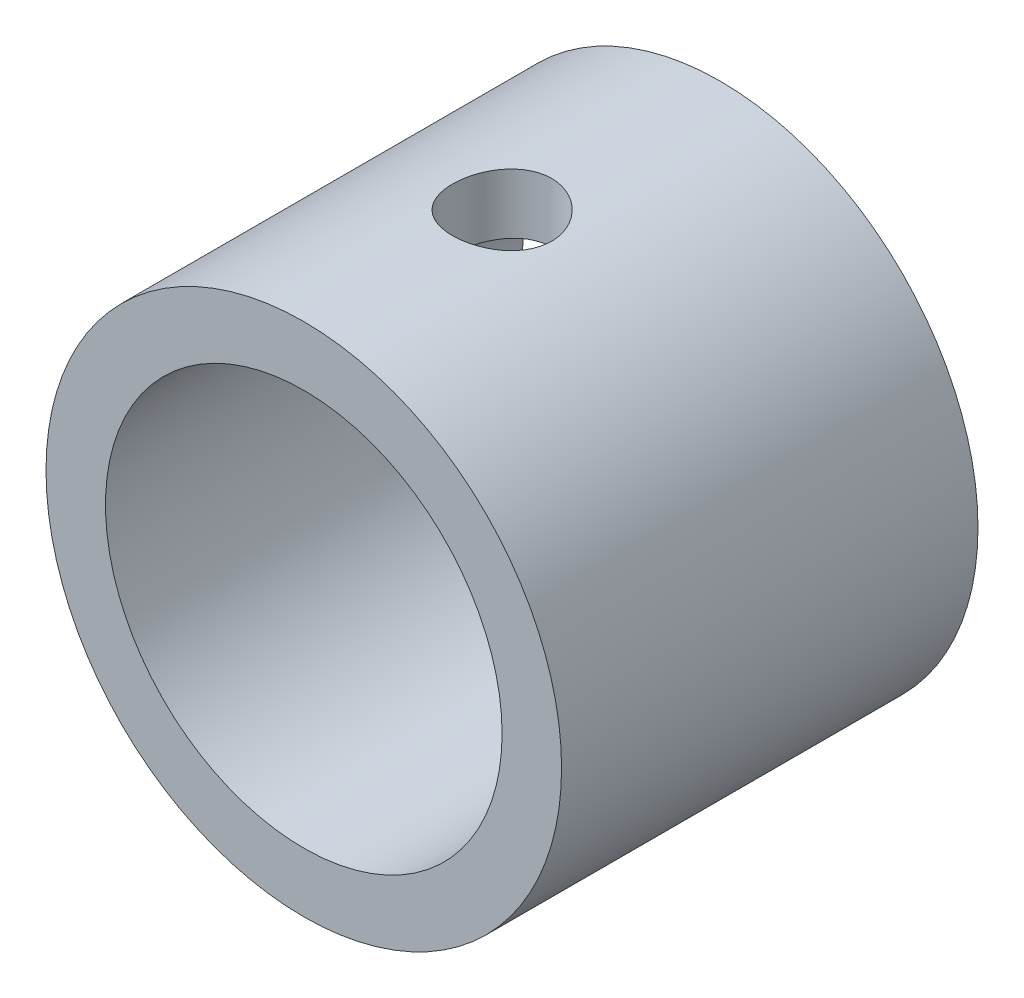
ISO-10303-21;
HEADER;
FILE_DESCRIPTION(('STEP AP214'),'2;1');
FILE_NAME('part.step','',(''),(''),'','','');
FILE_SCHEMA(('AUTOMOTIVE_DESIGN { 1 0 10303 214 1 1 1 1 }'));
ENDSEC;
DATA;
#1=APPLICATION_CONTEXT('core data for automotive mechanical design processes');
#2=APPLICATION_PROTOCOL_DEFINITION('international standard','automotive_design',2000,#1);
#3=PRODUCT_CONTEXT('',#1,'mechanical');
#4=PRODUCT('Part','Part','',(#3));
#5=PRODUCT_RELATED_PRODUCT_CATEGORY('part','',(#4));
#6=PRODUCT_DEFINITION_FORMATION('','',#4);
#7=PRODUCT_DEFINITION_CONTEXT('part definition',#1,'design');
#8=PRODUCT_DEFINITION('design','',#6,#7);
#9=PRODUCT_DEFINITION_SHAPE('','',#8);
#10=(LENGTH_UNIT() NAMED_UNIT(*) SI_UNIT(.MILLI.,.METRE.));
#11=(NAMED_UNIT(*) PLANE_ANGLE_UNIT() SI_UNIT($,.RADIAN.));
#12=(NAMED_UNIT(*) SI_UNIT($,.STERADIAN.) SOLID_ANGLE_UNIT());
#13=UNCERTAINTY_MEASURE_WITH_UNIT(LENGTH_MEASURE(1.E-05),#10,'distance_accuracy_value','');
#14=(GEOMETRIC_REPRESENTATION_CONTEXT(3) GLOBAL_UNCERTAINTY_ASSIGNED_CONTEXT((#13)) GLOBAL_UNIT_ASSIGNED_CONTEXT((#10,
#11,#12)) REPRESENTATION_CONTEXT('',''));
#15=CARTESIAN_POINT('',(0.,0.,0.));
#16=DIRECTION('',(0.,0.,1.));
#17=DIRECTION('',(1.,0.,0.));
#18=AXIS2_PLACEMENT_3D('',#15,#16,#17);
#19=CARTESIAN_POINT('',(0.,0.,21.));
#20=DIRECTION('',(0.,0.,1.));
#21=DIRECTION('',(1.,0.,0.));
#22=AXIS2_PLACEMENT_3D('',#19,#20,#21);
#23=PLANE('',#22);
#24=CARTESIAN_POINT('',(0.,0.,21.));
#25=DIRECTION('',(0.,0.,1.));
#26=DIRECTION('',(1.,0.,0.));
#27=AXIS2_PLACEMENT_3D('',#24,#25,#26);
#28=CIRCLE('',#27,13.);
#29=CARTESIAN_POINT('',(13.,0.,21.));
#30=VERTEX_POINT('',#29);
#31=EDGE_CURVE('E10',#30,#30,#28,.T.);
#32=ORIENTED_EDGE('',*,*,#31,.T.);
#33=EDGE_LOOP('',(#32));
#34=FACE_BOUND('',#33,.T.);
#35=CARTESIAN_POINT('',(0.,0.,21.));
#36=DIRECTION('',(0.,0.,1.));
#37=DIRECTION('',(1.,0.,0.));
#38=AXIS2_PLACEMENT_3D('',#35,#36,#37);
#39=CIRCLE('',#38,10.);
#40=CARTESIAN_POINT('',(10.,0.,21.));
#41=VERTEX_POINT('',#40);
#42=EDGE_CURVE('E45',#41,#41,#39,.T.);
#43=ORIENTED_EDGE('',*,*,#42,.F.);
#44=EDGE_LOOP('',(#43));
#45=FACE_BOUND('',#44,.T.);
#46=ADVANCED_FACE('F28',(#34,#45),#23,.T.);
#47=CARTESIAN_POINT('',(0.,0.,0.));
#48=DIRECTION('',(0.,0.,1.));
#49=DIRECTION('',(1.,0.,0.));
#50=AXIS2_PLACEMENT_3D('',#47,#48,#49);
#51=PLANE('',#50);
#52=CARTESIAN_POINT('',(0.,0.,0.));
#53=DIRECTION('',(0.,0.,1.));
#54=DIRECTION('',(1.,0.,0.));
#55=AXIS2_PLACEMENT_3D('',#52,#53,#54);
#56=CIRCLE('',#55,13.);
#57=CARTESIAN_POINT('',(13.,0.,0.));
#58=VERTEX_POINT('',#57);
#59=EDGE_CURVE('E41',#58,#58,#56,.T.);
#60=ORIENTED_EDGE('',*,*,#59,.F.);
#61=EDGE_LOOP('',(#60));
#62=FACE_BOUND('',#61,.T.);
#63=CARTESIAN_POINT('',(0.,0.,0.));
#64=DIRECTION('',(0.,0.,1.));
#65=DIRECTION('',(1.,0.,0.));
#66=AXIS2_PLACEMENT_3D('',#63,#64,#65);
#67=CIRCLE('',#66,10.);
#68=CARTESIAN_POINT('',(10.,0.,0.));
#69=VERTEX_POINT('',#68);
#70=EDGE_CURVE('E50',#69,#69,#67,.T.);
#71=ORIENTED_EDGE('',*,*,#70,.T.);
#72=EDGE_LOOP('',(#71));
#73=FACE_BOUND('',#72,.T.);
#74=ADVANCED_FACE('F67',(#62,#73),#51,.F.);
#75=CARTESIAN_POINT('',(0.,0.,21.));
#76=DIRECTION('',(0.,0.,-1.));
#77=DIRECTION('',(-1.,0.,0.));
#78=AXIS2_PLACEMENT_3D('',#75,#76,#77);
#79=CYLINDRICAL_SURFACE('',#78,13.);
#80=CARTESIAN_POINT('',(0.,13.,8.50000000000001));
#81=CARTESIAN_POINT('',(0.139052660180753,12.9999974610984,8.50000524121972));
#82=CARTESIAN_POINT('',(0.278172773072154,12.9977459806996,8.511640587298));
#83=CARTESIAN_POINT('',(0.552488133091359,12.9889814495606,8.55784194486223));
#84=CARTESIAN_POINT('',(0.687680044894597,12.9824648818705,8.59242688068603));
#85=CARTESIAN_POINT('',(0.950132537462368,12.9658986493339,8.68342558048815));
#86=CARTESIAN_POINT('',(1.07740031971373,12.9558522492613,8.73981917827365));
#87=CARTESIAN_POINT('',(1.32065723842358,12.9333215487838,8.87277612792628));
#88=CARTESIAN_POINT('',(1.43664719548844,12.9208374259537,8.94933801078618));
#89=CARTESIAN_POINT('',(1.65552432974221,12.8946323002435,9.12147916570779));
#90=CARTESIAN_POINT('',(1.75824929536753,12.8808989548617,9.21726283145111));
#91=CARTESIAN_POINT('',(1.94627668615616,12.8538341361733,9.42468903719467));
#92=CARTESIAN_POINT('',(2.03157781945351,12.8405026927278,9.53633275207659));
#93=CARTESIAN_POINT('',(2.18301679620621,12.8156309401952,9.77346399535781));
#94=CARTESIAN_POINT('',(2.24898851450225,12.8041065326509,9.89905943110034));
#95=CARTESIAN_POINT('',(2.35883220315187,12.7843281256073,10.1598099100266));
#96=CARTESIAN_POINT('',(2.40270618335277,12.7760738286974,10.2949640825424));
#97=CARTESIAN_POINT('',(2.46658610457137,12.7638947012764,10.5692561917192));
#98=CARTESIAN_POINT('',(2.48687558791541,12.7599184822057,10.7083257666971));
#99=CARTESIAN_POINT('',(2.5038909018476,12.7565908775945,10.98794763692));
#100=CARTESIAN_POINT('',(2.50061895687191,12.7572390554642,11.1284997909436));
#101=CARTESIAN_POINT('',(2.47083395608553,12.763040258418,11.4050352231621));
#102=CARTESIAN_POINT('',(2.44464430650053,12.7681305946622,11.5410548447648));
#103=CARTESIAN_POINT('',(2.37027708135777,12.7821440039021,11.8067329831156));
#104=CARTESIAN_POINT('',(2.3220985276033,12.7910672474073,11.9363912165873));
#105=CARTESIAN_POINT('',(2.20480765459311,12.8118060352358,12.1866069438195));
#106=CARTESIAN_POINT('',(2.13556565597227,12.8236394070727,12.307102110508));
#107=CARTESIAN_POINT('',(1.97820505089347,12.848853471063,12.5348849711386));
#108=CARTESIAN_POINT('',(1.89008443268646,12.8622343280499,12.6421712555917));
#109=CARTESIAN_POINT('',(1.69572891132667,12.889308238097,12.8423585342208));
#110=CARTESIAN_POINT('',(1.58921761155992,12.9030027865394,12.9349911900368));
#111=CARTESIAN_POINT('',(1.36202665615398,12.9289572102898,13.1011155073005));
#112=CARTESIAN_POINT('',(1.24134684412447,12.9412170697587,13.1746069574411));
#113=CARTESIAN_POINT('',(0.98895776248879,12.9629474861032,13.3004060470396));
#114=CARTESIAN_POINT('',(0.857233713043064,12.9724142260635,13.3526847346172));
#115=CARTESIAN_POINT('',(0.586650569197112,12.9874624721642,13.4342974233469));
#116=CARTESIAN_POINT('',(0.447792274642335,12.993044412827,13.4636339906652));
#117=CARTESIAN_POINT('',(0.169189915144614,12.9996341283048,13.4981537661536));
#118=CARTESIAN_POINT('',(0.0294929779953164,13.0007114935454,13.503704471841));
#119=CARTESIAN_POINT('',(-0.248832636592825,12.9983632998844,13.4914822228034));
#120=CARTESIAN_POINT('',(-0.387461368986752,12.994937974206,13.4737104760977));
#121=CARTESIAN_POINT('',(-0.658542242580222,12.9840126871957,13.415653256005));
#122=CARTESIAN_POINT('',(-0.791035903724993,12.976546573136,13.3755547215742));
#123=CARTESIAN_POINT('',(-1.04741955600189,12.9583735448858,13.2741852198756));
#124=CARTESIAN_POINT('',(-1.1713089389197,12.9476664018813,13.2129127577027));
#125=CARTESIAN_POINT('',(-1.40852868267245,12.924025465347,13.0701282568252));
#126=CARTESIAN_POINT('',(-1.52172218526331,12.9110676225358,12.9883929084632));
#127=CARTESIAN_POINT('',(-1.73291860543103,12.8844225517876,12.8073037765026));
#128=CARTESIAN_POINT('',(-1.83092002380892,12.8707352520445,12.707948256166));
#129=CARTESIAN_POINT('',(-2.01035510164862,12.8439416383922,12.492771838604));
#130=CARTESIAN_POINT('',(-2.09153739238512,12.8308461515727,12.376739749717));
#131=CARTESIAN_POINT('',(-2.23325948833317,12.8069410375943,12.1324696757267));
#132=CARTESIAN_POINT('',(-2.29380008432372,12.796131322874,12.0042321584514));
#133=CARTESIAN_POINT('',(-2.39216884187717,12.7781075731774,11.7398136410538));
#134=CARTESIAN_POINT('',(-2.43010977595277,12.770875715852,11.6036758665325));
#135=CARTESIAN_POINT('',(-2.48254790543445,12.7607868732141,11.3268049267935));
#136=CARTESIAN_POINT('',(-2.49704789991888,12.7579293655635,11.1860723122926));
#137=CARTESIAN_POINT('',(-2.50209511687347,12.7569402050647,10.9065266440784));
#138=CARTESIAN_POINT('',(-2.49303910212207,12.7587302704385,10.7677208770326));
#139=CARTESIAN_POINT('',(-2.4521026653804,12.7666604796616,10.4936500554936));
#140=CARTESIAN_POINT('',(-2.42022239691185,12.7728005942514,10.3583849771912));
#141=CARTESIAN_POINT('',(-2.33471347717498,12.7887053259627,10.095463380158));
#142=CARTESIAN_POINT('',(-2.28112994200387,12.7984624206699,9.96779170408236));
#143=CARTESIAN_POINT('',(-2.15377970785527,12.8205066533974,9.72318763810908));
#144=CARTESIAN_POINT('',(-2.08001148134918,12.8327939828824,9.60625606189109));
#145=CARTESIAN_POINT('',(-1.91301563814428,12.8587559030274,9.38446842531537));
#146=CARTESIAN_POINT('',(-1.81950009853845,12.8724492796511,9.27983131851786));
#147=CARTESIAN_POINT('',(-1.61626238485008,12.8995420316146,9.08760262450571));
#148=CARTESIAN_POINT('',(-1.50653649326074,12.9129413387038,9.00001495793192));
#149=CARTESIAN_POINT('',(-1.27273625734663,12.9380865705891,8.84358698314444));
#150=CARTESIAN_POINT('',(-1.14853493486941,12.9498154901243,8.77493362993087));
#151=CARTESIAN_POINT('',(-0.890172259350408,12.9701319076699,8.65957920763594));
#152=CARTESIAN_POINT('',(-0.756020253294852,12.9787223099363,8.6128578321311));
#153=CARTESIAN_POINT('',(-0.517923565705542,12.9900734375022,8.55201541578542));
#154=CARTESIAN_POINT('',(-0.415357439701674,12.9937745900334,8.53254351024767));
#155=CARTESIAN_POINT('',(-0.208540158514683,12.9987387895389,8.50653401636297));
#156=CARTESIAN_POINT('',(-0.104289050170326,13.0000019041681,8.499996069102));
#157=CARTESIAN_POINT('',(0.,13.,8.50000000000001));
#158=B_SPLINE_CURVE_WITH_KNOTS('',3,(#80,#81,#82,#83,#84,#85,#86,#87,#88,#89,#90,#91,#92,#93,
#94,#95,#96,#97,#98,#99,#100,#101,#102,#103,#104,#105,#106,#107,#108,#109,#110,#111,#112,#113,
#114,#115,#116,#117,#118,#119,#120,#121,#122,#123,#124,#125,#126,#127,#128,#129,#130,#131,#132,
#133,#134,#135,#136,#137,#138,#139,#140,#141,#142,#143,#144,#145,#146,#147,#148,#149,#150,#151,
#152,#153,#154,#155,#156,#157),.UNSPECIFIED.,.T.,.F.,(4,2,2,2,2,2,2,2,2,2,2,2,2,2,2,2,2,2,2,2,2,
2,2,2,2,2,2,2,2,2,2,2,2,2,2,2,2,2,4),(0.,0.41677654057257,0.833897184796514,1.25063304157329,
1.66733855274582,2.08873532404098,2.51016332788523,2.9351136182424,3.36002525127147,
3.77977378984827,4.19948270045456,4.61336264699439,5.02726100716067,5.44376099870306,
5.86030539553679,6.28376393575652,6.70722715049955,7.13126639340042,7.55525819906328,
7.97267505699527,8.39007029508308,8.80402218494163,9.21800330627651,9.63671570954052,
10.0554694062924,10.480090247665,10.9046948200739,11.3271624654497,11.7495796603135,
12.1649281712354,12.5802738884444,12.9947605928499,13.4092786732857,13.8303190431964,
14.2514561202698,14.6766136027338,15.1013766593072,15.4139664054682,15.7265474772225),.UNSPECIFIED.);
#159=CARTESIAN_POINT('',(0.,13.,8.50000000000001));
#160=VERTEX_POINT('',#159);
#161=EDGE_CURVE('E53',#160,#160,#158,.T.);
#162=ORIENTED_EDGE('',*,*,#161,.T.);
#163=EDGE_LOOP('',(#162));
#164=FACE_BOUND('',#163,.T.);
#165=ORIENTED_EDGE('',*,*,#31,.F.);
#166=EDGE_LOOP('',(#165));
#167=FACE_BOUND('',#166,.T.);
#168=ORIENTED_EDGE('',*,*,#59,.T.);
#169=EDGE_LOOP('',(#168));
#170=FACE_BOUND('',#169,.T.);
#171=ADVANCED_FACE('F30',(#164,#167,#170),#79,.T.);
#172=CARTESIAN_POINT('',(0.,0.,21.));
#173=DIRECTION('',(0.,0.,-1.));
#174=DIRECTION('',(-1.,0.,0.));
#175=AXIS2_PLACEMENT_3D('',#172,#173,#174);
#176=CYLINDRICAL_SURFACE('',#175,10.);
#177=CARTESIAN_POINT('',(0.,10.,8.50000000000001));
#178=CARTESIAN_POINT('',(0.138126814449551,9.99999766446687,8.50000387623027));
#179=CARTESIAN_POINT('',(0.276296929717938,9.99710963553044,8.51148591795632));
#180=CARTESIAN_POINT('',(0.548677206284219,9.98586856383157,8.55704191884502));
#181=CARTESIAN_POINT('',(0.682885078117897,9.97751242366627,8.59112868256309));
#182=CARTESIAN_POINT('',(0.943368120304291,9.9562604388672,8.68073208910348));
#183=CARTESIAN_POINT('',(1.06965260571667,9.94337004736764,8.73622299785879));
#184=CARTESIAN_POINT('',(1.31112021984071,9.91442239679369,8.86696898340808));
#185=CARTESIAN_POINT('',(1.4263029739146,9.89836503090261,8.94222472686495));
#186=CARTESIAN_POINT('',(1.64466987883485,9.86445689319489,9.11200131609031));
#187=CARTESIAN_POINT('',(1.74759281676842,9.84657845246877,9.20685262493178));
#188=CARTESIAN_POINT('',(1.93624821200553,9.81122700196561,9.41242034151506));
#189=CARTESIAN_POINT('',(2.02197872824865,9.79375403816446,9.5231385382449));
#190=CARTESIAN_POINT('',(2.17504423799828,9.76091292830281,9.75932537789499));
#191=CARTESIAN_POINT('',(2.24208702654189,9.74557990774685,9.88498871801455));
#192=CARTESIAN_POINT('',(2.35399484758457,9.71915824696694,10.1462473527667));
#193=CARTESIAN_POINT('',(2.39886342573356,9.70806892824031,10.2818410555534));
#194=CARTESIAN_POINT('',(2.46425806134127,9.69167461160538,10.5562391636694));
#195=CARTESIAN_POINT('',(2.48525378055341,9.68625818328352,10.69492482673));
#196=CARTESIAN_POINT('',(2.50376962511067,9.68148937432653,10.9739476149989));
#197=CARTESIAN_POINT('',(2.50129356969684,9.68213600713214,11.1142844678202));
#198=CARTESIAN_POINT('',(2.4733108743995,9.68932009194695,11.3890263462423));
#199=CARTESIAN_POINT('',(2.44836390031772,9.6957143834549,11.5234927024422));
#200=CARTESIAN_POINT('',(2.37704031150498,9.71344516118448,11.7862684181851));
#201=CARTESIAN_POINT('',(2.33066217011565,9.72478199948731,11.9145773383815));
#202=CARTESIAN_POINT('',(2.21731579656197,9.75125189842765,12.1628966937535));
#203=CARTESIAN_POINT('',(2.15014444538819,9.76642212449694,12.2828102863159));
#204=CARTESIAN_POINT('',(1.9972604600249,9.79882851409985,12.5098645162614));
#205=CARTESIAN_POINT('',(1.91154458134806,9.81606503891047,12.6170029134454));
#206=CARTESIAN_POINT('',(1.72110570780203,9.85126467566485,12.818672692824));
#207=CARTESIAN_POINT('',(1.61591043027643,9.86923449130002,12.9127574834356));
#208=CARTESIAN_POINT('',(1.39101986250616,9.90343275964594,13.0820354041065));
#209=CARTESIAN_POINT('',(1.27132412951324,9.91966115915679,13.1572279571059));
#210=CARTESIAN_POINT('',(1.02019314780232,9.9486288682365,13.2867509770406));
#211=CARTESIAN_POINT('',(0.888718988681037,9.96135600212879,13.341008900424));
#212=CARTESIAN_POINT('',(0.618126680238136,9.98179861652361,13.4265288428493));
#213=CARTESIAN_POINT('',(0.47900999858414,9.98951505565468,13.4577952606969));
#214=CARTESIAN_POINT('',(0.200899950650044,9.99892498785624,13.4957626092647));
#215=CARTESIAN_POINT('',(0.0619945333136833,10.0007675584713,13.5030717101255));
#216=CARTESIAN_POINT('',(-0.215054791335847,9.99864674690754,13.4945849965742));
#217=CARTESIAN_POINT('',(-0.353198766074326,9.99468388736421,13.4787912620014));
#218=CARTESIAN_POINT('',(-0.622690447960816,9.98149301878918,13.4250484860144));
#219=CARTESIAN_POINT('',(-0.754108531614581,9.97234390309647,13.3874312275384));
#220=CARTESIAN_POINT('',(-1.00876215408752,9.94981177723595,13.2914881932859));
#221=CARTESIAN_POINT('',(-1.13199686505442,9.93642833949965,13.2331603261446));
#222=CARTESIAN_POINT('',(-1.36920522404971,9.9065551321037,13.0962731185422));
#223=CARTESIAN_POINT('',(-1.48297573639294,9.89001445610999,13.0173731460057));
#224=CARTESIAN_POINT('',(-1.69587768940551,9.85574181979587,12.8420168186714));
#225=CARTESIAN_POINT('',(-1.79500659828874,9.83800965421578,12.7455574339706));
#226=CARTESIAN_POINT('',(-1.97831761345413,9.80281594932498,12.5349967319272));
#227=CARTESIAN_POINT('',(-2.06207311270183,9.78537173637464,12.4205204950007));
#228=CARTESIAN_POINT('',(-2.20918459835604,9.75321463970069,12.1787789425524));
#229=CARTESIAN_POINT('',(-2.272541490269,9.73850163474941,12.0515141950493));
#230=CARTESIAN_POINT('',(-2.37658570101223,9.71363491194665,11.7884904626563));
#231=CARTESIAN_POINT('',(-2.4174073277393,9.70345425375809,11.6527872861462));
#232=CARTESIAN_POINT('',(-2.47557609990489,9.68877906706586,11.3761506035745));
#233=CARTESIAN_POINT('',(-2.49292837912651,9.68428329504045,11.2352182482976));
#234=CARTESIAN_POINT('',(-2.50339765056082,9.68158168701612,10.9564649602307));
#235=CARTESIAN_POINT('',(-2.49719649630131,9.68319887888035,10.8186709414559));
#236=CARTESIAN_POINT('',(-2.46229546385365,9.69213181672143,10.5461601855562));
#237=CARTESIAN_POINT('',(-2.43359603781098,9.69944744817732,10.4114433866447));
#238=CARTESIAN_POINT('',(-2.35488553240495,9.71885434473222,10.1496525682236));
#239=CARTESIAN_POINT('',(-2.30500234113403,9.73091692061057,10.0225378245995));
#240=CARTESIAN_POINT('',(-2.18544152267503,9.7584625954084,9.77839102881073));
#241=CARTESIAN_POINT('',(-2.11576115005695,9.77394616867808,9.66136037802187));
#242=CARTESIAN_POINT('',(-1.95644624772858,9.80709390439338,9.43740895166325));
#243=CARTESIAN_POINT('',(-1.86633860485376,9.82480441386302,9.33083154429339));
#244=CARTESIAN_POINT('',(-1.66964895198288,9.86013378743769,9.13408825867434));
#245=CARTESIAN_POINT('',(-1.56306303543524,9.87775262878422,9.04392628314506));
#246=CARTESIAN_POINT('',(-1.33411264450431,9.91129426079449,8.88098115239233));
#247=CARTESIAN_POINT('',(-1.21149737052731,9.92718055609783,8.80854231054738));
#248=CARTESIAN_POINT('',(-0.955443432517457,9.95508208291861,8.68542089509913));
#249=CARTESIAN_POINT('',(-0.822012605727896,9.96710008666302,8.63472273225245));
#250=CARTESIAN_POINT('',(-0.574017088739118,9.98413432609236,8.56404694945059));
#251=CARTESIAN_POINT('',(-0.460633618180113,9.99004308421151,8.54008126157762));
#252=CARTESIAN_POINT('',(-0.231510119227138,9.99797675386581,8.50805676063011));
#253=CARTESIAN_POINT('',(-0.115770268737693,10.0000019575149,8.49999675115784));
#254=CARTESIAN_POINT('',(0.,10.,8.50000000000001));
#255=B_SPLINE_CURVE_WITH_KNOTS('',3,(#177,#178,#179,#180,#181,#182,#183,#184,#185,#186,#187,
#188,#189,#190,#191,#192,#193,#194,#195,#196,#197,#198,#199,#200,#201,#202,#203,#204,#205,#206,
#207,#208,#209,#210,#211,#212,#213,#214,#215,#216,#217,#218,#219,#220,#221,#222,#223,#224,#225,
#226,#227,#228,#229,#230,#231,#232,#233,#234,#235,#236,#237,#238,#239,#240,#241,#242,#243,#244,
#245,#246,#247,#248,#249,#250,#251,#252,#253,#254),.UNSPECIFIED.,.T.,.F.,(4,2,2,2,2,2,2,2,2,2,2,
2,2,2,2,2,2,2,2,2,2,2,2,2,2,2,2,2,2,2,2,2,2,2,2,2,2,2,4),(0.,0.413956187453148,0.82814706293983,
1.24184150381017,1.65554990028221,2.07690725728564,2.49831215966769,2.92597745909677,
3.3535743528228,3.77260491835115,4.19156730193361,4.6003749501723,5.0092117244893,
5.42217546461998,5.83521151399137,6.26002501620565,6.68485149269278,7.11113715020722,
7.53734122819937,7.95263848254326,8.36789835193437,8.77700457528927,9.18615212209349,
9.60255979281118,10.0190393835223,10.4457418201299,10.8724253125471,11.2965375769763,
11.7205570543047,12.1323963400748,12.5442273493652,12.9536066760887,13.3630428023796,
13.7831596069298,14.2033761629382,14.6312030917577,15.0587227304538,15.4057040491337,
15.7526592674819),.UNSPECIFIED.);
#256=CARTESIAN_POINT('',(0.,10.,8.50000000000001));
#257=VERTEX_POINT('',#256);
#258=EDGE_CURVE('E33',#257,#257,#255,.T.);
#259=ORIENTED_EDGE('',*,*,#258,.F.);
#260=EDGE_LOOP('',(#259));
#261=FACE_BOUND('',#260,.T.);
#262=ORIENTED_EDGE('',*,*,#42,.T.);
#263=EDGE_LOOP('',(#262));
#264=FACE_BOUND('',#263,.T.);
#265=ORIENTED_EDGE('',*,*,#70,.F.);
#266=EDGE_LOOP('',(#265));
#267=FACE_BOUND('',#266,.T.);
#268=ADVANCED_FACE('F60',(#261,#264,#267),#176,.F.);
#269=CARTESIAN_POINT('',(0.,0.,11.));
#270=DIRECTION('',(0.,-1.,0.));
#271=DIRECTION('',(0.,0.,-1.));
#272=AXIS2_PLACEMENT_3D('',#269,#270,#271);
#273=CYLINDRICAL_SURFACE('',#272,2.49999999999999);
#274=ORIENTED_EDGE('',*,*,#258,.T.);
#275=EDGE_LOOP('',(#274));
#276=FACE_BOUND('',#275,.T.);
#277=ORIENTED_EDGE('',*,*,#161,.F.);
#278=EDGE_LOOP('',(#277));
#279=FACE_BOUND('',#278,.T.);
#280=ADVANCED_FACE('F57',(#276,#279),#273,.F.);
#281=CLOSED_SHELL('',(#46,#74,#171,#268,#280));
#282=MANIFOLD_SOLID_BREP('B2',#281);
#283=ADVANCED_BREP_SHAPE_REPRESENTATION('',(#18,#282),#14);
#284=SHAPE_DEFINITION_REPRESENTATION(#9,#283);
ENDSEC;
END-ISO-10303-21;
